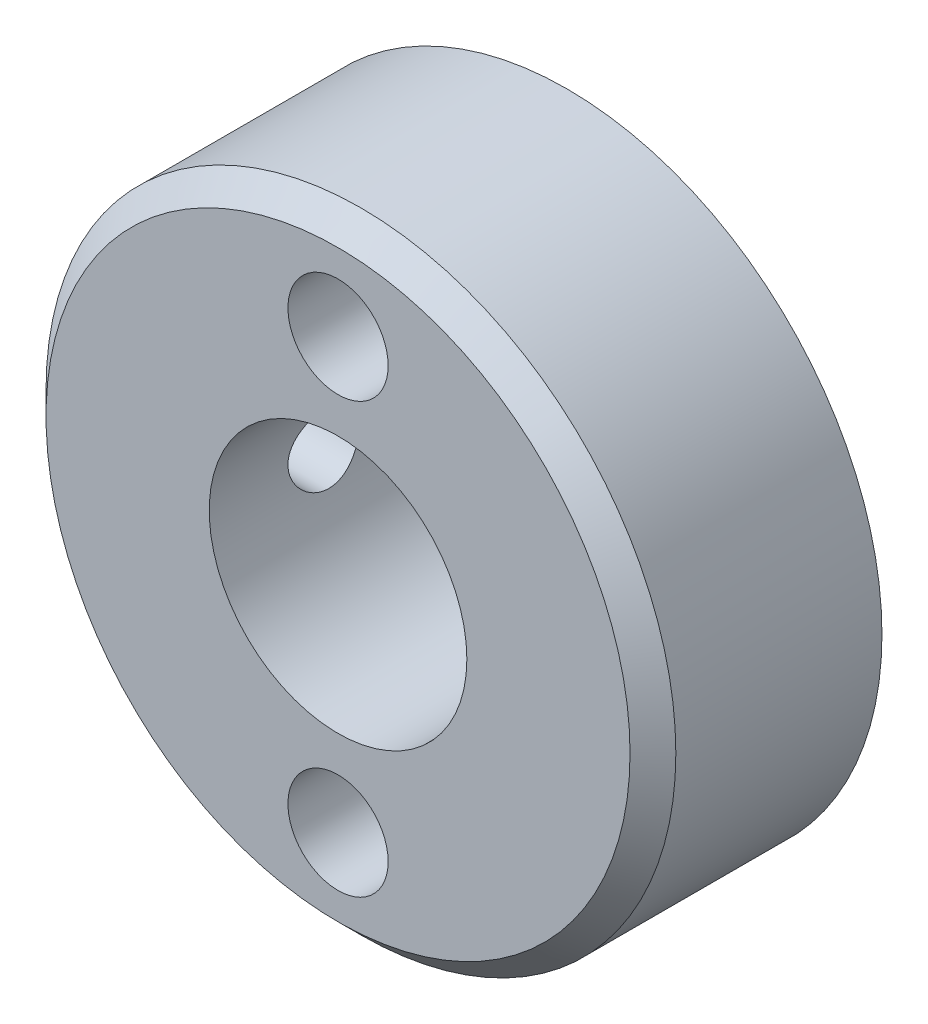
from build123d import *

# Parameters (mm, degrees)
SKETCH1_R          = 11
SKETCH1_R_2        = 4.5
BASENUT_DEPTH      = 8
CHAMFER1_SIZE      = 0.8
SKETCH3_R          = 1.25
CUT_EXTRUDE1_DEPTH = 18.492855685


with BuildPart() as part:
    # Sketch1 → BaseNut (new body)
    with BuildSketch(Plane.XY):
        Circle(SKETCH1_R)
        Circle(SKETCH1_R_2, mode=Mode.SUBTRACT)
    extrude(amount=-BASENUT_DEPTH)

    # Sketch5 → Cut-Revolve1 (revolve, cut)
    with BuildSketch(Plane(origin=(0, 0, 0), x_dir=(0, 0, -1), z_dir=(1, 0, 0)), mode=Mode.PRIVATE) as cut_revolve1_sk:
        Polygon((0, 7.5), (0, 9.25), (4, 9.25), (5.010362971, 7.5), align=None)
    cut_revolve1 = revolve(cut_revolve1_sk.sketch.rotate(Axis((0, 7.5, 6.070310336), (0, 0, -1)), 90), axis=Axis((0, 7.5, 6.070310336), (0, 0, -1)), mode=Mode.SUBTRACT)

    # Chamfer1
    chamfer1_edges = [part.edges().sort_by_distance(p)[0] for p in [
        (-11, 0, 0),
        (-4.5, 0, -8),
    ]]
    chamfer(chamfer1_edges, length=CHAMFER1_SIZE)

    # Sketch3 → Cut-Extrude1 (cut, through all)
    with BuildSketch(Plane(origin=(0, 0, 0), x_dir=(0, -1, 0), z_dir=(1, 0, 0))):
        with Locations(Location((0, 4, 0), (0, 0, 90))):
            Circle(SKETCH3_R)
    extrude(amount=-CUT_EXTRUDE1_DEPTH, mode=Mode.SUBTRACT)

    # Mirror1: Cut-Revolve1 across plane
    add(cut_revolve1.mirror(Plane.ZX), mode=Mode.SUBTRACT)


solid = part.part
